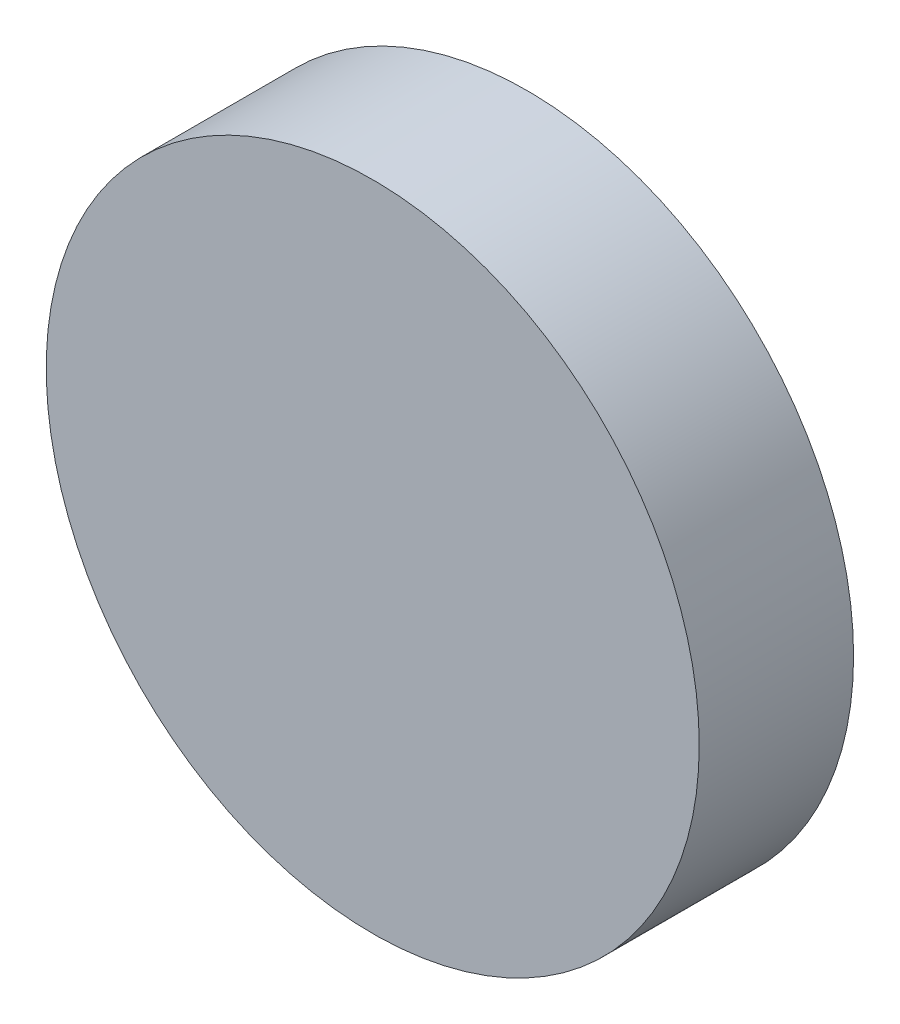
ISO-10303-21;
HEADER;
FILE_DESCRIPTION(('STEP AP214'),'2;1');
FILE_NAME('part.step','',(''),(''),'','','');
FILE_SCHEMA(('AUTOMOTIVE_DESIGN { 1 0 10303 214 1 1 1 1 }'));
ENDSEC;
DATA;
#1=APPLICATION_CONTEXT('core data for automotive mechanical design processes');
#2=APPLICATION_PROTOCOL_DEFINITION('international standard','automotive_design',2000,#1);
#3=PRODUCT_CONTEXT('',#1,'mechanical');
#4=PRODUCT('Part','Part','',(#3));
#5=PRODUCT_RELATED_PRODUCT_CATEGORY('part','',(#4));
#6=PRODUCT_DEFINITION_FORMATION('','',#4);
#7=PRODUCT_DEFINITION_CONTEXT('part definition',#1,'design');
#8=PRODUCT_DEFINITION('design','',#6,#7);
#9=PRODUCT_DEFINITION_SHAPE('','',#8);
#10=(LENGTH_UNIT() NAMED_UNIT(*) SI_UNIT(.MILLI.,.METRE.));
#11=(NAMED_UNIT(*) PLANE_ANGLE_UNIT() SI_UNIT($,.RADIAN.));
#12=(NAMED_UNIT(*) SI_UNIT($,.STERADIAN.) SOLID_ANGLE_UNIT());
#13=UNCERTAINTY_MEASURE_WITH_UNIT(LENGTH_MEASURE(1.E-05),#10,'distance_accuracy_value','');
#14=(GEOMETRIC_REPRESENTATION_CONTEXT(3) GLOBAL_UNCERTAINTY_ASSIGNED_CONTEXT((#13)) GLOBAL_UNIT_ASSIGNED_CONTEXT((#10,
#11,#12)) REPRESENTATION_CONTEXT('',''));
#15=CARTESIAN_POINT('',(0.,0.,0.));
#16=DIRECTION('',(0.,0.,1.));
#17=DIRECTION('',(1.,0.,0.));
#18=AXIS2_PLACEMENT_3D('',#15,#16,#17);
#19=CARTESIAN_POINT('',(0.,0.,26.));
#20=DIRECTION('',(0.,0.,1.));
#21=DIRECTION('',(1.,0.,0.));
#22=AXIS2_PLACEMENT_3D('',#19,#20,#21);
#23=PLANE('',#22);
#24=CARTESIAN_POINT('',(0.,0.,26.));
#25=DIRECTION('',(0.,0.,1.));
#26=DIRECTION('',(1.,0.,0.));
#27=AXIS2_PLACEMENT_3D('',#24,#25,#26);
#28=CIRCLE('',#27,55.);
#29=CARTESIAN_POINT('',(55.,0.,26.));
#30=VERTEX_POINT('',#29);
#31=EDGE_CURVE('E10',#30,#30,#28,.T.);
#32=ORIENTED_EDGE('',*,*,#31,.T.);
#33=EDGE_LOOP('',(#32));
#34=FACE_BOUND('',#33,.T.);
#35=ADVANCED_FACE('F16',(#34),#23,.T.);
#36=CARTESIAN_POINT('',(0.,0.,0.));
#37=DIRECTION('',(0.,0.,1.));
#38=DIRECTION('',(1.,0.,0.));
#39=AXIS2_PLACEMENT_3D('',#36,#37,#38);
#40=PLANE('',#39);
#41=CARTESIAN_POINT('',(0.,0.,0.));
#42=DIRECTION('',(0.,0.,1.));
#43=DIRECTION('',(1.,0.,0.));
#44=AXIS2_PLACEMENT_3D('',#41,#42,#43);
#45=CIRCLE('',#44,55.);
#46=CARTESIAN_POINT('',(55.,0.,0.));
#47=VERTEX_POINT('',#46);
#48=EDGE_CURVE('E41',#47,#47,#45,.T.);
#49=ORIENTED_EDGE('',*,*,#48,.F.);
#50=EDGE_LOOP('',(#49));
#51=FACE_BOUND('',#50,.T.);
#52=ADVANCED_FACE('F55',(#51),#40,.F.);
#53=CARTESIAN_POINT('',(0.,0.,0.));
#54=DIRECTION('',(0.,0.,-1.));
#55=DIRECTION('',(1.,0.,0.));
#56=AXIS2_PLACEMENT_3D('',#53,#54,#55);
#57=CYLINDRICAL_SURFACE('',#56,55.);
#58=ORIENTED_EDGE('',*,*,#48,.T.);
#59=DIRECTION('',(0.,0.,1.));
#60=VECTOR('',#59,1.);
#61=CARTESIAN_POINT('',(55.,0.,0.));
#62=LINE('',#61,#60);
#63=EDGE_CURVE('E24',#47,#30,#62,.T.);
#64=ORIENTED_EDGE('',*,*,#63,.T.);
#65=ORIENTED_EDGE('',*,*,#31,.F.);
#66=ORIENTED_EDGE('',*,*,#63,.F.);
#67=EDGE_LOOP('',(#58,#64,#65,#66));
#68=FACE_BOUND('',#67,.T.);
#69=ADVANCED_FACE('F39',(#68),#57,.T.);
#70=CLOSED_SHELL('',(#35,#52,#69));
#71=MANIFOLD_SOLID_BREP('B1',#70);
#72=ADVANCED_BREP_SHAPE_REPRESENTATION('',(#18,#71),#14);
#73=SHAPE_DEFINITION_REPRESENTATION(#9,#72);
ENDSEC;
END-ISO-10303-21;
